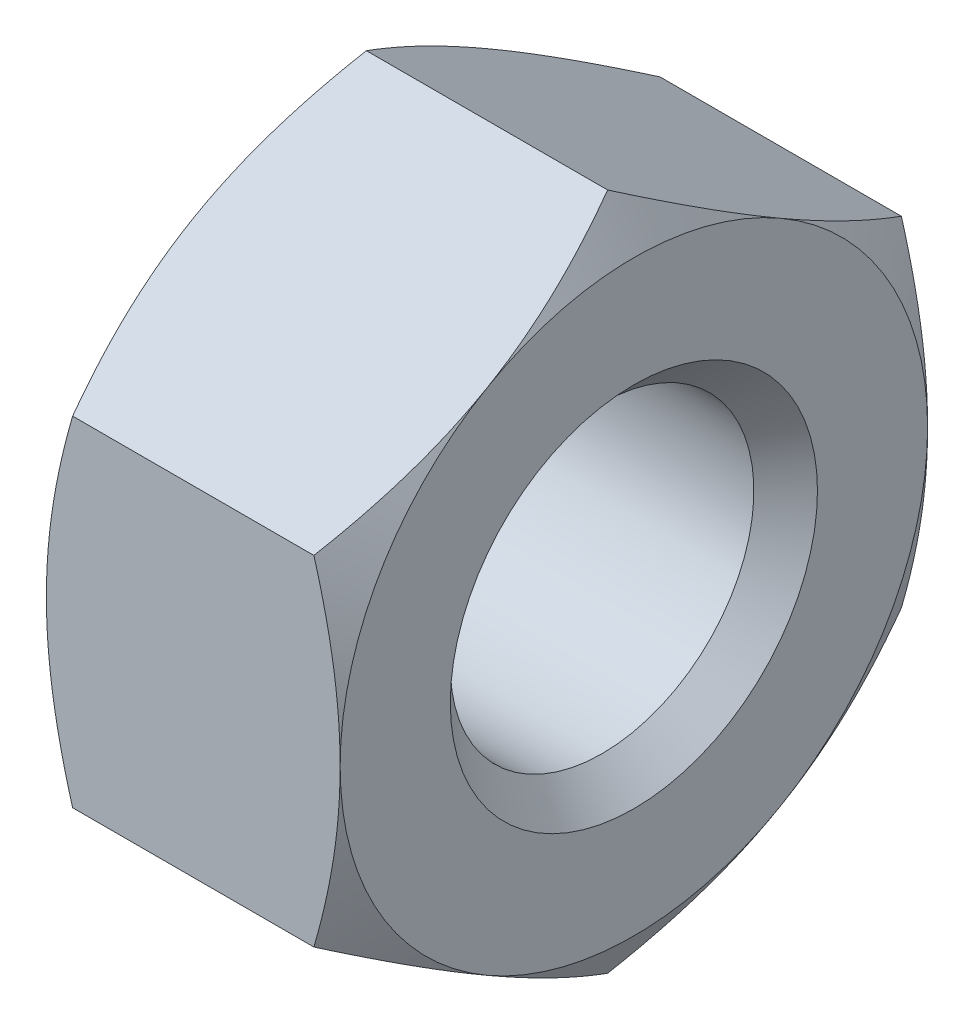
ISO-10303-21;
HEADER;
FILE_DESCRIPTION(('STEP AP214'),'2;1');
FILE_NAME('part.step','',(''),(''),'','','');
FILE_SCHEMA(('AUTOMOTIVE_DESIGN { 1 0 10303 214 1 1 1 1 }'));
ENDSEC;
DATA;
#1=APPLICATION_CONTEXT('core data for automotive mechanical design processes');
#2=APPLICATION_PROTOCOL_DEFINITION('international standard','automotive_design',2000,#1);
#3=PRODUCT_CONTEXT('',#1,'mechanical');
#4=PRODUCT('Part','Part','',(#3));
#5=PRODUCT_RELATED_PRODUCT_CATEGORY('part','',(#4));
#6=PRODUCT_DEFINITION_FORMATION('','',#4);
#7=PRODUCT_DEFINITION_CONTEXT('part definition',#1,'design');
#8=PRODUCT_DEFINITION('design','',#6,#7);
#9=PRODUCT_DEFINITION_SHAPE('','',#8);
#10=(LENGTH_UNIT() NAMED_UNIT(*) SI_UNIT(.MILLI.,.METRE.));
#11=(NAMED_UNIT(*) PLANE_ANGLE_UNIT() SI_UNIT($,.RADIAN.));
#12=(NAMED_UNIT(*) SI_UNIT($,.STERADIAN.) SOLID_ANGLE_UNIT());
#13=UNCERTAINTY_MEASURE_WITH_UNIT(LENGTH_MEASURE(1.E-05),#10,'distance_accuracy_value','');
#14=(GEOMETRIC_REPRESENTATION_CONTEXT(3) GLOBAL_UNCERTAINTY_ASSIGNED_CONTEXT((#13)) GLOBAL_UNIT_ASSIGNED_CONTEXT((#10,
#11,#12)) REPRESENTATION_CONTEXT('',''));
#15=CARTESIAN_POINT('',(0.,0.,0.));
#16=DIRECTION('',(0.,0.,1.));
#17=DIRECTION('',(1.,0.,0.));
#18=AXIS2_PLACEMENT_3D('',#15,#16,#17);
#19=DIRECTION('',(-0.707106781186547,0.707106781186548,0.));
#20=VECTOR('',#19,1.);
#21=CARTESIAN_POINT('',(-498997.5,499000.,0.));
#22=LINE('',#21,#20);
#23=CARTESIAN_POINT('',(2.5,0.,0.));
#24=DIRECTION('',(-1.,0.,0.));
#25=AXIS1_PLACEMENT('',#23,#24);
#26=SURFACE_OF_REVOLUTION('',#22,#25);
#27=CARTESIAN_POINT('',(0.433,0.,0.));
#28=DIRECTION('',(-1.,0.,0.));
#29=DIRECTION('',(0.,1.,0.));
#30=AXIS2_PLACEMENT_3D('',#27,#28,#29);
#31=CIRCLE('',#30,2.067);
#32=CARTESIAN_POINT('',(0.433,2.067,0.));
#33=VERTEX_POINT('',#32);
#34=EDGE_CURVE('E312',#33,#33,#31,.T.);
#35=ORIENTED_EDGE('',*,*,#34,.F.);
#36=EDGE_LOOP('',(#35));
#37=FACE_BOUND('',#36,.T.);
#38=CARTESIAN_POINT('',(0.,0.,0.));
#39=DIRECTION('',(-1.,0.,0.));
#40=DIRECTION('',(0.,1.,0.));
#41=AXIS2_PLACEMENT_3D('',#38,#39,#40);
#42=CIRCLE('',#41,2.5);
#43=CARTESIAN_POINT('',(0.,2.5,0.));
#44=VERTEX_POINT('',#43);
#45=EDGE_CURVE('E297',#44,#44,#42,.T.);
#46=ORIENTED_EDGE('',*,*,#45,.T.);
#47=EDGE_LOOP('',(#46));
#48=FACE_BOUND('',#47,.T.);
#49=ADVANCED_FACE('F16',(#37,#48),#26,.F.);
#50=CARTESIAN_POINT('',(0.,3.25,0.));
#51=DIRECTION('',(-1.,0.,0.));
#52=DIRECTION('',(0.,-1.,0.));
#53=AXIS2_PLACEMENT_3D('',#50,#51,#52);
#54=PLANE('',#53);
#55=CARTESIAN_POINT('',(0.,0.,0.));
#56=DIRECTION('',(-1.,0.,0.));
#57=DIRECTION('',(0.,1.,0.));
#58=AXIS2_PLACEMENT_3D('',#55,#56,#57);
#59=CIRCLE('',#58,4.);
#60=CARTESIAN_POINT('',(0.,3.46410161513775,2.));
#61=VERTEX_POINT('',#60);
#62=CARTESIAN_POINT('',(0.,3.46410161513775,-2.));
#63=VERTEX_POINT('',#62);
#64=EDGE_CURVE('E11',#61,#63,#59,.T.);
#65=ORIENTED_EDGE('',*,*,#64,.T.);
#66=CARTESIAN_POINT('',(0.,0.,0.));
#67=DIRECTION('',(-1.,0.,0.));
#68=DIRECTION('',(0.,1.,0.));
#69=AXIS2_PLACEMENT_3D('',#66,#67,#68);
#70=CIRCLE('',#69,4.);
#71=CARTESIAN_POINT('',(0.,0.,-4.));
#72=VERTEX_POINT('',#71);
#73=EDGE_CURVE('E26',#63,#72,#70,.T.);
#74=ORIENTED_EDGE('',*,*,#73,.T.);
#75=CARTESIAN_POINT('',(0.,0.,0.));
#76=DIRECTION('',(-1.,0.,0.));
#77=DIRECTION('',(0.,1.,0.));
#78=AXIS2_PLACEMENT_3D('',#75,#76,#77);
#79=CIRCLE('',#78,4.);
#80=CARTESIAN_POINT('',(0.,-3.46410161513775,-2.));
#81=VERTEX_POINT('',#80);
#82=EDGE_CURVE('E118',#72,#81,#79,.T.);
#83=ORIENTED_EDGE('',*,*,#82,.T.);
#84=CARTESIAN_POINT('',(0.,0.,0.));
#85=DIRECTION('',(-1.,0.,0.));
#86=DIRECTION('',(0.,1.,0.));
#87=AXIS2_PLACEMENT_3D('',#84,#85,#86);
#88=CIRCLE('',#87,4.);
#89=CARTESIAN_POINT('',(0.,-3.46410161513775,2.));
#90=VERTEX_POINT('',#89);
#91=EDGE_CURVE('E360',#81,#90,#88,.T.);
#92=ORIENTED_EDGE('',*,*,#91,.T.);
#93=CARTESIAN_POINT('',(0.,0.,0.));
#94=DIRECTION('',(-1.,0.,0.));
#95=DIRECTION('',(0.,1.,0.));
#96=AXIS2_PLACEMENT_3D('',#93,#94,#95);
#97=CIRCLE('',#96,4.);
#98=CARTESIAN_POINT('',(0.,0.,4.));
#99=VERTEX_POINT('',#98);
#100=EDGE_CURVE('E363',#90,#99,#97,.T.);
#101=ORIENTED_EDGE('',*,*,#100,.T.);
#102=CARTESIAN_POINT('',(0.,0.,0.));
#103=DIRECTION('',(-1.,0.,0.));
#104=DIRECTION('',(0.,1.,0.));
#105=AXIS2_PLACEMENT_3D('',#102,#103,#104);
#106=CIRCLE('',#105,4.);
#107=EDGE_CURVE('E262',#99,#61,#106,.T.);
#108=ORIENTED_EDGE('',*,*,#107,.T.);
#109=EDGE_LOOP('',(#65,#74,#83,#92,#101,#108));
#110=FACE_BOUND('',#109,.T.);
#111=ORIENTED_EDGE('',*,*,#45,.F.);
#112=EDGE_LOOP('',(#111));
#113=FACE_BOUND('',#112,.T.);
#114=ADVANCED_FACE('F149',(#110,#113),#54,.T.);
#115=CARTESIAN_POINT('',(4.,3.25,0.));
#116=DIRECTION('',(1.,0.,0.));
#117=DIRECTION('',(0.,0.,-1.));
#118=AXIS2_PLACEMENT_3D('',#115,#116,#117);
#119=PLANE('',#118);
#120=CARTESIAN_POINT('',(4.,0.,0.));
#121=DIRECTION('',(-1.,0.,0.));
#122=DIRECTION('',(0.,1.,0.));
#123=AXIS2_PLACEMENT_3D('',#120,#121,#122);
#124=CIRCLE('',#123,2.5);
#125=CARTESIAN_POINT('',(4.,2.5,0.));
#126=VERTEX_POINT('',#125);
#127=EDGE_CURVE('E383',#126,#126,#124,.T.);
#128=ORIENTED_EDGE('',*,*,#127,.T.);
#129=EDGE_LOOP('',(#128));
#130=FACE_BOUND('',#129,.T.);
#131=CARTESIAN_POINT('',(4.,0.,0.));
#132=DIRECTION('',(-1.,0.,0.));
#133=DIRECTION('',(0.,1.,0.));
#134=AXIS2_PLACEMENT_3D('',#131,#132,#133);
#135=CIRCLE('',#134,4.);
#136=CARTESIAN_POINT('',(4.,3.46410161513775,2.));
#137=VERTEX_POINT('',#136);
#138=CARTESIAN_POINT('',(4.,3.46410161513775,-2.));
#139=VERTEX_POINT('',#138);
#140=EDGE_CURVE('E336',#137,#139,#135,.T.);
#141=ORIENTED_EDGE('',*,*,#140,.F.);
#142=CARTESIAN_POINT('',(4.,0.,0.));
#143=DIRECTION('',(-1.,0.,0.));
#144=DIRECTION('',(0.,1.,0.));
#145=AXIS2_PLACEMENT_3D('',#142,#143,#144);
#146=CIRCLE('',#145,4.);
#147=CARTESIAN_POINT('',(4.,0.,4.));
#148=VERTEX_POINT('',#147);
#149=EDGE_CURVE('E137',#148,#137,#146,.T.);
#150=ORIENTED_EDGE('',*,*,#149,.F.);
#151=CARTESIAN_POINT('',(4.,0.,0.));
#152=DIRECTION('',(-1.,0.,0.));
#153=DIRECTION('',(0.,1.,0.));
#154=AXIS2_PLACEMENT_3D('',#151,#152,#153);
#155=CIRCLE('',#154,4.);
#156=CARTESIAN_POINT('',(4.,-3.46410161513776,2.));
#157=VERTEX_POINT('',#156);
#158=EDGE_CURVE('E281',#157,#148,#155,.T.);
#159=ORIENTED_EDGE('',*,*,#158,.F.);
#160=CARTESIAN_POINT('',(4.,0.,0.));
#161=DIRECTION('',(-1.,0.,0.));
#162=DIRECTION('',(0.,1.,0.));
#163=AXIS2_PLACEMENT_3D('',#160,#161,#162);
#164=CIRCLE('',#163,4.);
#165=CARTESIAN_POINT('',(4.,-3.46410161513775,-2.));
#166=VERTEX_POINT('',#165);
#167=EDGE_CURVE('E369',#166,#157,#164,.T.);
#168=ORIENTED_EDGE('',*,*,#167,.F.);
#169=CARTESIAN_POINT('',(4.,0.,0.));
#170=DIRECTION('',(-1.,0.,0.));
#171=DIRECTION('',(0.,1.,0.));
#172=AXIS2_PLACEMENT_3D('',#169,#170,#171);
#173=CIRCLE('',#172,4.);
#174=CARTESIAN_POINT('',(4.,0.,-4.));
#175=VERTEX_POINT('',#174);
#176=EDGE_CURVE('E302',#175,#166,#173,.T.);
#177=ORIENTED_EDGE('',*,*,#176,.F.);
#178=CARTESIAN_POINT('',(4.,0.,0.));
#179=DIRECTION('',(-1.,0.,0.));
#180=DIRECTION('',(0.,1.,0.));
#181=AXIS2_PLACEMENT_3D('',#178,#179,#180);
#182=CIRCLE('',#181,4.);
#183=EDGE_CURVE('E292',#139,#175,#182,.T.);
#184=ORIENTED_EDGE('',*,*,#183,.F.);
#185=EDGE_LOOP('',(#141,#150,#159,#168,#177,#184));
#186=FACE_BOUND('',#185,.T.);
#187=ADVANCED_FACE('F153',(#130,#186),#119,.T.);
#188=DIRECTION('',(0.707106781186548,0.707106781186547,0.));
#189=VECTOR('',#188,1.);
#190=CARTESIAN_POINT('',(499000.,498998.499999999,0.));
#191=LINE('',#190,#189);
#192=CARTESIAN_POINT('',(1.5,0.,0.));
#193=DIRECTION('',(1.,0.,0.));
#194=AXIS1_PLACEMENT('',#192,#193);
#195=SURFACE_OF_REVOLUTION('',#191,#194);
#196=ORIENTED_EDGE('',*,*,#127,.F.);
#197=EDGE_LOOP('',(#196));
#198=FACE_BOUND('',#197,.T.);
#199=CARTESIAN_POINT('',(3.567,0.,0.));
#200=DIRECTION('',(-1.,0.,0.));
#201=DIRECTION('',(0.,1.,0.));
#202=AXIS2_PLACEMENT_3D('',#199,#200,#201);
#203=CIRCLE('',#202,2.067);
#204=CARTESIAN_POINT('',(3.567,2.067,0.));
#205=VERTEX_POINT('',#204);
#206=EDGE_CURVE('E127',#205,#205,#203,.T.);
#207=ORIENTED_EDGE('',*,*,#206,.T.);
#208=EDGE_LOOP('',(#207));
#209=FACE_BOUND('',#208,.T.);
#210=ADVANCED_FACE('F157',(#198,#209),#195,.F.);
#211=CARTESIAN_POINT('',(2.,0.,0.));
#212=DIRECTION('',(1.,0.,0.));
#213=DIRECTION('',(0.,1.,0.));
#214=AXIS2_PLACEMENT_3D('',#211,#212,#213);
#215=CIRCLE('',#214,2.067);
#216=DIRECTION('',(-1.,0.,0.));
#217=VECTOR('',#216,1.);
#218=SURFACE_OF_LINEAR_EXTRUSION('',#215,#217);
#219=ORIENTED_EDGE('',*,*,#206,.F.);
#220=EDGE_LOOP('',(#219));
#221=FACE_BOUND('',#220,.T.);
#222=ORIENTED_EDGE('',*,*,#34,.T.);
#223=EDGE_LOOP('',(#222));
#224=FACE_BOUND('',#223,.T.);
#225=ADVANCED_FACE('F161',(#221,#224),#218,.T.);
#226=DIRECTION('',(0.5,-0.866025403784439,0.));
#227=VECTOR('',#226,1.);
#228=CARTESIAN_POINT('',(-288091.474924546,499000.,0.));
#229=LINE('',#228,#227);
#230=CARTESIAN_POINT('',(6.3094010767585,0.,0.));
#231=DIRECTION('',(-1.,0.,0.));
#232=AXIS1_PLACEMENT('',#230,#231);
#233=SURFACE_OF_REVOLUTION('',#229,#232);
#234=CARTESIAN_POINT('',(4.,3.46410161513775,2.));
#235=CARTESIAN_POINT('',(4.,2.92820323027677,2.92820323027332));
#236=CARTESIAN_POINT('',(3.64273441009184,2.3094010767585,4.));
#237=(BOUNDED_CURVE() B_SPLINE_CURVE(2,(#234,#235,#236),.UNSPECIFIED.,.F.,
.F.) B_SPLINE_CURVE_WITH_KNOTS((3,3),(6.65279109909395,9.59814287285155),
.UNSPECIFIED.) CURVE() GEOMETRIC_REPRESENTATION_ITEM() RATIONAL_B_SPLINE_CURVE((1.,
1.08725434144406,1.09724946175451)) REPRESENTATION_ITEM(''));
#238=CARTESIAN_POINT('',(3.64273441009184,2.3094010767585,4.));
#239=VERTEX_POINT('',#238);
#240=EDGE_CURVE('E277',#137,#239,#237,.T.);
#241=ORIENTED_EDGE('',*,*,#240,.T.);
#242=CARTESIAN_POINT('',(3.64273441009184,2.3094010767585,4.));
#243=CARTESIAN_POINT('',(4.,1.07179676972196,4.));
#244=CARTESIAN_POINT('',(4.,0.,4.));
#245=(BOUNDED_CURVE() B_SPLINE_CURVE(2,(#242,#243,#244),.UNSPECIFIED.,.F.,
.F.) B_SPLINE_CURVE_WITH_KNOTS((3,3),(3.70743932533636,6.65279109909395),
.UNSPECIFIED.) CURVE() GEOMETRIC_REPRESENTATION_ITEM() RATIONAL_B_SPLINE_CURVE((1.09724946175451,
1.08725434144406,1.)) REPRESENTATION_ITEM(''));
#246=EDGE_CURVE('E268',#239,#148,#245,.T.);
#247=ORIENTED_EDGE('',*,*,#246,.T.);
#248=ORIENTED_EDGE('',*,*,#149,.T.);
#249=EDGE_LOOP('',(#241,#247,#248));
#250=FACE_BOUND('',#249,.T.);
#251=ADVANCED_FACE('F165',(#250),#233,.F.);
#252=DIRECTION('',(0.5,-0.866025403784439,0.));
#253=VECTOR('',#252,1.);
#254=CARTESIAN_POINT('',(-288091.474924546,499000.,0.));
#255=LINE('',#254,#253);
#256=CARTESIAN_POINT('',(6.3094010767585,0.,0.));
#257=DIRECTION('',(-1.,0.,0.));
#258=AXIS1_PLACEMENT('',#256,#257);
#259=SURFACE_OF_REVOLUTION('',#255,#258);
#260=CARTESIAN_POINT('',(4.,3.46410161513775,-2.));
#261=CARTESIAN_POINT('',(4.,3.99999999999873,-1.07179676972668));
#262=CARTESIAN_POINT('',(3.64273441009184,4.61880215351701,0.));
#263=(BOUNDED_CURVE() B_SPLINE_CURVE(2,(#260,#261,#262),.UNSPECIFIED.,.F.,
.F.) B_SPLINE_CURVE_WITH_KNOTS((3,3),(6.65279109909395,9.59814287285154),
.UNSPECIFIED.) CURVE() GEOMETRIC_REPRESENTATION_ITEM() RATIONAL_B_SPLINE_CURVE((1.,
1.08725434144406,1.09724946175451)) REPRESENTATION_ITEM(''));
#264=CARTESIAN_POINT('',(3.64273441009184,4.61880215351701,0.));
#265=VERTEX_POINT('',#264);
#266=EDGE_CURVE('E129',#139,#265,#263,.T.);
#267=ORIENTED_EDGE('',*,*,#266,.T.);
#268=CARTESIAN_POINT('',(3.64273441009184,4.61880215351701,0.));
#269=CARTESIAN_POINT('',(4.,3.99999999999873,1.07179676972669));
#270=CARTESIAN_POINT('',(4.,3.46410161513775,2.));
#271=(BOUNDED_CURVE() B_SPLINE_CURVE(2,(#268,#269,#270),.UNSPECIFIED.,.F.,
.F.) B_SPLINE_CURVE_WITH_KNOTS((3,3),(3.70743932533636,6.65279109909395),
.UNSPECIFIED.) CURVE() GEOMETRIC_REPRESENTATION_ITEM() RATIONAL_B_SPLINE_CURVE((1.09724946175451,
1.08725434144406,1.)) REPRESENTATION_ITEM(''));
#272=EDGE_CURVE('E138',#265,#137,#271,.T.);
#273=ORIENTED_EDGE('',*,*,#272,.T.);
#274=ORIENTED_EDGE('',*,*,#140,.T.);
#275=EDGE_LOOP('',(#267,#273,#274));
#276=FACE_BOUND('',#275,.T.);
#277=ADVANCED_FACE('F176',(#276),#259,.F.);
#278=DIRECTION('',(0.5,-0.866025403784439,0.));
#279=VECTOR('',#278,1.);
#280=CARTESIAN_POINT('',(-288091.474924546,499000.,0.));
#281=LINE('',#280,#279);
#282=CARTESIAN_POINT('',(6.3094010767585,0.,0.));
#283=DIRECTION('',(-1.,0.,0.));
#284=AXIS1_PLACEMENT('',#282,#283);
#285=SURFACE_OF_REVOLUTION('',#281,#284);
#286=CARTESIAN_POINT('',(4.,0.,-4.));
#287=CARTESIAN_POINT('',(4.,1.07179676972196,-4.));
#288=CARTESIAN_POINT('',(3.64273441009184,2.3094010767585,-4.));
#289=(BOUNDED_CURVE() B_SPLINE_CURVE(2,(#286,#287,#288),.UNSPECIFIED.,.F.,
.F.) B_SPLINE_CURVE_WITH_KNOTS((3,3),(6.65279109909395,9.59814287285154),
.UNSPECIFIED.) CURVE() GEOMETRIC_REPRESENTATION_ITEM() RATIONAL_B_SPLINE_CURVE((1.,
1.08725434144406,1.09724946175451)) REPRESENTATION_ITEM(''));
#290=CARTESIAN_POINT('',(3.64273441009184,2.3094010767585,-4.));
#291=VERTEX_POINT('',#290);
#292=EDGE_CURVE('E291',#175,#291,#289,.T.);
#293=ORIENTED_EDGE('',*,*,#292,.T.);
#294=CARTESIAN_POINT('',(3.64273441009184,2.3094010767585,-4.));
#295=CARTESIAN_POINT('',(4.,2.92820323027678,-2.92820323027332));
#296=CARTESIAN_POINT('',(4.,3.46410161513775,-2.));
#297=(BOUNDED_CURVE() B_SPLINE_CURVE(2,(#294,#295,#296),.UNSPECIFIED.,.F.,
.F.) B_SPLINE_CURVE_WITH_KNOTS((3,3),(3.70743932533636,6.65279109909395),
.UNSPECIFIED.) CURVE() GEOMETRIC_REPRESENTATION_ITEM() RATIONAL_B_SPLINE_CURVE((1.09724946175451,
1.08725434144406,1.)) REPRESENTATION_ITEM(''));
#298=EDGE_CURVE('E286',#291,#139,#297,.T.);
#299=ORIENTED_EDGE('',*,*,#298,.T.);
#300=ORIENTED_EDGE('',*,*,#183,.T.);
#301=EDGE_LOOP('',(#293,#299,#300));
#302=FACE_BOUND('',#301,.T.);
#303=ADVANCED_FACE('F179',(#302),#285,.F.);
#304=DIRECTION('',(0.5,-0.866025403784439,0.));
#305=VECTOR('',#304,1.);
#306=CARTESIAN_POINT('',(-288091.474924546,499000.,0.));
#307=LINE('',#306,#305);
#308=CARTESIAN_POINT('',(6.3094010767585,0.,0.));
#309=DIRECTION('',(-1.,0.,0.));
#310=AXIS1_PLACEMENT('',#308,#309);
#311=SURFACE_OF_REVOLUTION('',#307,#310);
#312=CARTESIAN_POINT('',(3.64273441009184,-2.3094010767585,-4.));
#313=CARTESIAN_POINT('',(4.,-1.07179676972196,-4.));
#314=CARTESIAN_POINT('',(4.,0.,-4.));
#315=(BOUNDED_CURVE() B_SPLINE_CURVE(2,(#312,#313,#314),.UNSPECIFIED.,.F.,
.F.) B_SPLINE_CURVE_WITH_KNOTS((3,3),(3.70743932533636,6.65279109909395),
.UNSPECIFIED.) CURVE() GEOMETRIC_REPRESENTATION_ITEM() RATIONAL_B_SPLINE_CURVE((1.09724946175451,
1.08725434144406,1.)) REPRESENTATION_ITEM(''));
#316=CARTESIAN_POINT('',(3.64273441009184,-2.3094010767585,-4.));
#317=VERTEX_POINT('',#316);
#318=EDGE_CURVE('E101',#317,#175,#315,.T.);
#319=ORIENTED_EDGE('',*,*,#318,.T.);
#320=ORIENTED_EDGE('',*,*,#176,.T.);
#321=CARTESIAN_POINT('',(4.,-3.46410161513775,-2.));
#322=CARTESIAN_POINT('',(4.,-2.92820323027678,-2.92820323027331));
#323=CARTESIAN_POINT('',(3.64273441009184,-2.3094010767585,-4.));
#324=(BOUNDED_CURVE() B_SPLINE_CURVE(2,(#321,#322,#323),.UNSPECIFIED.,.F.,
.F.) B_SPLINE_CURVE_WITH_KNOTS((3,3),(6.65279109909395,9.59814287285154),
.UNSPECIFIED.) CURVE() GEOMETRIC_REPRESENTATION_ITEM() RATIONAL_B_SPLINE_CURVE((1.,
1.08725434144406,1.09724946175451)) REPRESENTATION_ITEM(''));
#325=EDGE_CURVE('E298',#166,#317,#324,.T.);
#326=ORIENTED_EDGE('',*,*,#325,.T.);
#327=EDGE_LOOP('',(#319,#320,#326));
#328=FACE_BOUND('',#327,.T.);
#329=ADVANCED_FACE('F183',(#328),#311,.F.);
#330=DIRECTION('',(0.5,-0.866025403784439,0.));
#331=VECTOR('',#330,1.);
#332=CARTESIAN_POINT('',(-288091.474924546,499000.,0.));
#333=LINE('',#332,#331);
#334=CARTESIAN_POINT('',(6.3094010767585,0.,0.));
#335=DIRECTION('',(-1.,0.,0.));
#336=AXIS1_PLACEMENT('',#334,#335);
#337=SURFACE_OF_REVOLUTION('',#333,#336);
#338=CARTESIAN_POINT('',(3.64273441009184,-4.61880215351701,0.));
#339=CARTESIAN_POINT('',(4.,-3.99999999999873,-1.07179676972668));
#340=CARTESIAN_POINT('',(4.,-3.46410161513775,-2.));
#341=(BOUNDED_CURVE() B_SPLINE_CURVE(2,(#338,#339,#340),.UNSPECIFIED.,.F.,
.F.) B_SPLINE_CURVE_WITH_KNOTS((3,3),(3.70743932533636,6.65279109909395),
.UNSPECIFIED.) CURVE() GEOMETRIC_REPRESENTATION_ITEM() RATIONAL_B_SPLINE_CURVE((1.09724946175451,
1.08725434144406,1.)) REPRESENTATION_ITEM(''));
#342=CARTESIAN_POINT('',(3.64273441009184,-4.61880215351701,0.));
#343=VERTEX_POINT('',#342);
#344=EDGE_CURVE('E303',#343,#166,#341,.T.);
#345=ORIENTED_EDGE('',*,*,#344,.T.);
#346=ORIENTED_EDGE('',*,*,#167,.T.);
#347=CARTESIAN_POINT('',(4.,-3.46410161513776,2.));
#348=CARTESIAN_POINT('',(4.,-3.99999999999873,1.07179676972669));
#349=CARTESIAN_POINT('',(3.64273441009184,-4.61880215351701,0.));
#350=(BOUNDED_CURVE() B_SPLINE_CURVE(2,(#347,#348,#349),.UNSPECIFIED.,.F.,
.F.) B_SPLINE_CURVE_WITH_KNOTS((3,3),(6.65279109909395,9.59814287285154),
.UNSPECIFIED.) CURVE() GEOMETRIC_REPRESENTATION_ITEM() RATIONAL_B_SPLINE_CURVE((1.,
1.08725434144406,1.09724946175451)) REPRESENTATION_ITEM(''));
#351=EDGE_CURVE('E311',#157,#343,#350,.T.);
#352=ORIENTED_EDGE('',*,*,#351,.T.);
#353=EDGE_LOOP('',(#345,#346,#352));
#354=FACE_BOUND('',#353,.T.);
#355=ADVANCED_FACE('F187',(#354),#337,.F.);
#356=DIRECTION('',(0.5,-0.866025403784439,0.));
#357=VECTOR('',#356,1.);
#358=CARTESIAN_POINT('',(-288091.474924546,499000.,0.));
#359=LINE('',#358,#357);
#360=CARTESIAN_POINT('',(6.3094010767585,0.,0.));
#361=DIRECTION('',(-1.,0.,0.));
#362=AXIS1_PLACEMENT('',#360,#361);
#363=SURFACE_OF_REVOLUTION('',#359,#362);
#364=CARTESIAN_POINT('',(3.64273441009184,-2.3094010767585,4.));
#365=CARTESIAN_POINT('',(4.,-2.92820323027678,2.92820323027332));
#366=CARTESIAN_POINT('',(4.,-3.46410161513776,2.));
#367=(BOUNDED_CURVE() B_SPLINE_CURVE(2,(#364,#365,#366),.UNSPECIFIED.,.F.,
.F.) B_SPLINE_CURVE_WITH_KNOTS((3,3),(3.70743932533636,6.65279109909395),
.UNSPECIFIED.) CURVE() GEOMETRIC_REPRESENTATION_ITEM() RATIONAL_B_SPLINE_CURVE((1.09724946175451,
1.08725434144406,1.)) REPRESENTATION_ITEM(''));
#368=CARTESIAN_POINT('',(3.64273441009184,-2.3094010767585,4.));
#369=VERTEX_POINT('',#368);
#370=EDGE_CURVE('E284',#369,#157,#367,.T.);
#371=ORIENTED_EDGE('',*,*,#370,.T.);
#372=ORIENTED_EDGE('',*,*,#158,.T.);
#373=CARTESIAN_POINT('',(4.,0.,4.));
#374=CARTESIAN_POINT('',(4.,-1.07179676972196,4.));
#375=CARTESIAN_POINT('',(3.64273441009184,-2.3094010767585,4.));
#376=(BOUNDED_CURVE() B_SPLINE_CURVE(2,(#373,#374,#375),.UNSPECIFIED.,.F.,
.F.) B_SPLINE_CURVE_WITH_KNOTS((3,3),(6.65279109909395,9.59814287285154),
.UNSPECIFIED.) CURVE() GEOMETRIC_REPRESENTATION_ITEM() RATIONAL_B_SPLINE_CURVE((1.,
1.08725434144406,1.09724946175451)) REPRESENTATION_ITEM(''));
#377=EDGE_CURVE('E285',#148,#369,#376,.T.);
#378=ORIENTED_EDGE('',*,*,#377,.T.);
#379=EDGE_LOOP('',(#371,#372,#378));
#380=FACE_BOUND('',#379,.T.);
#381=ADVANCED_FACE('F198',(#380),#363,.F.);
#382=DIRECTION('',(-0.5,-0.866025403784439,0.));
#383=VECTOR('',#382,1.);
#384=CARTESIAN_POINT('',(288095.474924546,499000.,0.));
#385=LINE('',#384,#383);
#386=CARTESIAN_POINT('',(-2.3094010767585,0.,0.));
#387=DIRECTION('',(1.,0.,0.));
#388=AXIS1_PLACEMENT('',#386,#387);
#389=SURFACE_OF_REVOLUTION('',#385,#388);
#390=CARTESIAN_POINT('',(0.,3.46410161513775,2.));
#391=CARTESIAN_POINT('',(0.,3.99999999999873,1.07179676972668));
#392=CARTESIAN_POINT('',(0.357265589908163,4.61880215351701,0.));
#393=(BOUNDED_CURVE() B_SPLINE_CURVE(2,(#390,#391,#392),.UNSPECIFIED.,.F.,
.F.) B_SPLINE_CURVE_WITH_KNOTS((3,3),(6.65279109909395,9.59814287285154),
.UNSPECIFIED.) CURVE() GEOMETRIC_REPRESENTATION_ITEM() RATIONAL_B_SPLINE_CURVE((1.,
1.08725434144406,1.09724946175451)) REPRESENTATION_ITEM(''));
#394=CARTESIAN_POINT('',(0.357265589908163,4.61880215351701,0.));
#395=VERTEX_POINT('',#394);
#396=EDGE_CURVE('E255',#61,#395,#393,.T.);
#397=ORIENTED_EDGE('',*,*,#396,.T.);
#398=CARTESIAN_POINT('',(0.357265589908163,4.61880215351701,0.));
#399=CARTESIAN_POINT('',(0.,3.99999999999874,-1.07179676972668));
#400=CARTESIAN_POINT('',(0.,3.46410161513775,-2.));
#401=(BOUNDED_CURVE() B_SPLINE_CURVE(2,(#398,#399,#400),.UNSPECIFIED.,.F.,
.F.) B_SPLINE_CURVE_WITH_KNOTS((3,3),(3.70743932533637,6.65279109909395),
.UNSPECIFIED.) CURVE() GEOMETRIC_REPRESENTATION_ITEM() RATIONAL_B_SPLINE_CURVE((1.09724946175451,
1.08725434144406,1.)) REPRESENTATION_ITEM(''));
#402=EDGE_CURVE('E265',#395,#63,#401,.T.);
#403=ORIENTED_EDGE('',*,*,#402,.T.);
#404=ORIENTED_EDGE('',*,*,#64,.F.);
#405=EDGE_LOOP('',(#397,#403,#404));
#406=FACE_BOUND('',#405,.T.);
#407=ADVANCED_FACE('F201',(#406),#389,.F.);
#408=DIRECTION('',(-0.5,-0.866025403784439,0.));
#409=VECTOR('',#408,1.);
#410=CARTESIAN_POINT('',(288095.474924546,499000.,0.));
#411=LINE('',#410,#409);
#412=CARTESIAN_POINT('',(-2.3094010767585,0.,0.));
#413=DIRECTION('',(1.,0.,0.));
#414=AXIS1_PLACEMENT('',#412,#413);
#415=SURFACE_OF_REVOLUTION('',#411,#414);
#416=CARTESIAN_POINT('',(0.,0.,4.));
#417=CARTESIAN_POINT('',(0.,1.07179676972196,4.));
#418=CARTESIAN_POINT('',(0.357265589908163,2.3094010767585,4.));
#419=(BOUNDED_CURVE() B_SPLINE_CURVE(2,(#416,#417,#418),.UNSPECIFIED.,.F.,
.F.) B_SPLINE_CURVE_WITH_KNOTS((3,3),(6.65279109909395,9.59814287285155),
.UNSPECIFIED.) CURVE() GEOMETRIC_REPRESENTATION_ITEM() RATIONAL_B_SPLINE_CURVE((1.,
1.08725434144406,1.09724946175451)) REPRESENTATION_ITEM(''));
#420=CARTESIAN_POINT('',(0.357265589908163,2.3094010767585,4.));
#421=VERTEX_POINT('',#420);
#422=EDGE_CURVE('E258',#99,#421,#419,.T.);
#423=ORIENTED_EDGE('',*,*,#422,.T.);
#424=CARTESIAN_POINT('',(0.357265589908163,2.3094010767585,4.));
#425=CARTESIAN_POINT('',(0.,2.92820323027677,2.92820323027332));
#426=CARTESIAN_POINT('',(0.,3.46410161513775,2.));
#427=(BOUNDED_CURVE() B_SPLINE_CURVE(2,(#424,#425,#426),.UNSPECIFIED.,.F.,
.F.) B_SPLINE_CURVE_WITH_KNOTS((3,3),(3.70743932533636,6.65279109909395),
.UNSPECIFIED.) CURVE() GEOMETRIC_REPRESENTATION_ITEM() RATIONAL_B_SPLINE_CURVE((1.09724946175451,
1.08725434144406,1.)) REPRESENTATION_ITEM(''));
#428=EDGE_CURVE('E248',#421,#61,#427,.T.);
#429=ORIENTED_EDGE('',*,*,#428,.T.);
#430=ORIENTED_EDGE('',*,*,#107,.F.);
#431=EDGE_LOOP('',(#423,#429,#430));
#432=FACE_BOUND('',#431,.T.);
#433=ADVANCED_FACE('F205',(#432),#415,.F.);
#434=DIRECTION('',(-0.5,-0.866025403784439,0.));
#435=VECTOR('',#434,1.);
#436=CARTESIAN_POINT('',(288095.474924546,499000.,0.));
#437=LINE('',#436,#435);
#438=CARTESIAN_POINT('',(-2.3094010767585,0.,0.));
#439=DIRECTION('',(1.,0.,0.));
#440=AXIS1_PLACEMENT('',#438,#439);
#441=SURFACE_OF_REVOLUTION('',#437,#440);
#442=CARTESIAN_POINT('',(0.,-3.46410161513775,2.));
#443=CARTESIAN_POINT('',(0.,-2.92820323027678,2.92820323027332));
#444=CARTESIAN_POINT('',(0.357265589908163,-2.3094010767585,4.));
#445=(BOUNDED_CURVE() B_SPLINE_CURVE(2,(#442,#443,#444),.UNSPECIFIED.,.F.,
.F.) B_SPLINE_CURVE_WITH_KNOTS((3,3),(6.65279109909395,9.59814287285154),
.UNSPECIFIED.) CURVE() GEOMETRIC_REPRESENTATION_ITEM() RATIONAL_B_SPLINE_CURVE((1.,
1.08725434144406,1.09724946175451)) REPRESENTATION_ITEM(''));
#446=CARTESIAN_POINT('',(0.357265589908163,-2.3094010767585,4.));
#447=VERTEX_POINT('',#446);
#448=EDGE_CURVE('E259',#90,#447,#445,.T.);
#449=ORIENTED_EDGE('',*,*,#448,.T.);
#450=CARTESIAN_POINT('',(0.357265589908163,-2.3094010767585,4.));
#451=CARTESIAN_POINT('',(0.,-1.07179676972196,4.));
#452=CARTESIAN_POINT('',(0.,0.,4.));
#453=(BOUNDED_CURVE() B_SPLINE_CURVE(2,(#450,#451,#452),.UNSPECIFIED.,.F.,
.F.) B_SPLINE_CURVE_WITH_KNOTS((3,3),(3.70743932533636,6.65279109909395),
.UNSPECIFIED.) CURVE() GEOMETRIC_REPRESENTATION_ITEM() RATIONAL_B_SPLINE_CURVE((1.09724946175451,
1.08725434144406,1.)) REPRESENTATION_ITEM(''));
#454=EDGE_CURVE('E322',#447,#99,#453,.T.);
#455=ORIENTED_EDGE('',*,*,#454,.T.);
#456=ORIENTED_EDGE('',*,*,#100,.F.);
#457=EDGE_LOOP('',(#449,#455,#456));
#458=FACE_BOUND('',#457,.T.);
#459=ADVANCED_FACE('F209',(#458),#441,.F.);
#460=DIRECTION('',(-0.5,-0.866025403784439,0.));
#461=VECTOR('',#460,1.);
#462=CARTESIAN_POINT('',(288095.474924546,499000.,0.));
#463=LINE('',#462,#461);
#464=CARTESIAN_POINT('',(-2.3094010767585,0.,0.));
#465=DIRECTION('',(1.,0.,0.));
#466=AXIS1_PLACEMENT('',#464,#465);
#467=SURFACE_OF_REVOLUTION('',#463,#466);
#468=CARTESIAN_POINT('',(0.357265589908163,-4.61880215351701,0.));
#469=CARTESIAN_POINT('',(0.,-3.99999999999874,1.07179676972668));
#470=CARTESIAN_POINT('',(0.,-3.46410161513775,2.));
#471=(BOUNDED_CURVE() B_SPLINE_CURVE(2,(#468,#469,#470),.UNSPECIFIED.,.F.,
.F.) B_SPLINE_CURVE_WITH_KNOTS((3,3),(3.70743932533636,6.65279109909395),
.UNSPECIFIED.) CURVE() GEOMETRIC_REPRESENTATION_ITEM() RATIONAL_B_SPLINE_CURVE((1.09724946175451,
1.08725434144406,1.)) REPRESENTATION_ITEM(''));
#472=CARTESIAN_POINT('',(0.357265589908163,-4.61880215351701,0.));
#473=VERTEX_POINT('',#472);
#474=EDGE_CURVE('E318',#473,#90,#471,.T.);
#475=ORIENTED_EDGE('',*,*,#474,.T.);
#476=ORIENTED_EDGE('',*,*,#91,.F.);
#477=CARTESIAN_POINT('',(0.,-3.46410161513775,-2.));
#478=CARTESIAN_POINT('',(0.,-3.99999999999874,-1.07179676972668));
#479=CARTESIAN_POINT('',(0.357265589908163,-4.61880215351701,0.));
#480=(BOUNDED_CURVE() B_SPLINE_CURVE(2,(#477,#478,#479),.UNSPECIFIED.,.F.,
.F.) B_SPLINE_CURVE_WITH_KNOTS((3,3),(6.65279109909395,9.59814287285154),
.UNSPECIFIED.) CURVE() GEOMETRIC_REPRESENTATION_ITEM() RATIONAL_B_SPLINE_CURVE((1.,
1.08725434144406,1.09724946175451)) REPRESENTATION_ITEM(''));
#481=EDGE_CURVE('E112',#81,#473,#480,.T.);
#482=ORIENTED_EDGE('',*,*,#481,.T.);
#483=EDGE_LOOP('',(#475,#476,#482));
#484=FACE_BOUND('',#483,.T.);
#485=ADVANCED_FACE('F218',(#484),#467,.F.);
#486=DIRECTION('',(-0.5,-0.866025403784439,0.));
#487=VECTOR('',#486,1.);
#488=CARTESIAN_POINT('',(288095.474924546,499000.,0.));
#489=LINE('',#488,#487);
#490=CARTESIAN_POINT('',(-2.3094010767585,0.,0.));
#491=DIRECTION('',(1.,0.,0.));
#492=AXIS1_PLACEMENT('',#490,#491);
#493=SURFACE_OF_REVOLUTION('',#489,#492);
#494=CARTESIAN_POINT('',(0.357265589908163,-2.3094010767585,-4.));
#495=CARTESIAN_POINT('',(0.,-2.92820323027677,-2.92820323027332));
#496=CARTESIAN_POINT('',(0.,-3.46410161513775,-2.));
#497=(BOUNDED_CURVE() B_SPLINE_CURVE(2,(#494,#495,#496),.UNSPECIFIED.,.F.,
.F.) B_SPLINE_CURVE_WITH_KNOTS((3,3),(3.70743932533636,6.65279109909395),
.UNSPECIFIED.) CURVE() GEOMETRIC_REPRESENTATION_ITEM() RATIONAL_B_SPLINE_CURVE((1.09724946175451,
1.08725434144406,1.)) REPRESENTATION_ITEM(''));
#498=CARTESIAN_POINT('',(0.357265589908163,-2.3094010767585,-4.));
#499=VERTEX_POINT('',#498);
#500=EDGE_CURVE('E109',#499,#81,#497,.T.);
#501=ORIENTED_EDGE('',*,*,#500,.T.);
#502=ORIENTED_EDGE('',*,*,#82,.F.);
#503=CARTESIAN_POINT('',(0.,0.,-4.));
#504=CARTESIAN_POINT('',(0.,-1.07179676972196,-4.));
#505=CARTESIAN_POINT('',(0.357265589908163,-2.3094010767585,-4.));
#506=(BOUNDED_CURVE() B_SPLINE_CURVE(2,(#503,#504,#505),.UNSPECIFIED.,.F.,
.F.) B_SPLINE_CURVE_WITH_KNOTS((3,3),(6.65279109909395,9.59814287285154),
.UNSPECIFIED.) CURVE() GEOMETRIC_REPRESENTATION_ITEM() RATIONAL_B_SPLINE_CURVE((1.,
1.08725434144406,1.09724946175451)) REPRESENTATION_ITEM(''));
#507=EDGE_CURVE('E98',#72,#499,#506,.T.);
#508=ORIENTED_EDGE('',*,*,#507,.T.);
#509=EDGE_LOOP('',(#501,#502,#508));
#510=FACE_BOUND('',#509,.T.);
#511=ADVANCED_FACE('F117',(#510),#493,.F.);
#512=DIRECTION('',(-0.5,-0.866025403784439,0.));
#513=VECTOR('',#512,1.);
#514=CARTESIAN_POINT('',(288095.474924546,499000.,0.));
#515=LINE('',#514,#513);
#516=CARTESIAN_POINT('',(-2.3094010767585,0.,0.));
#517=DIRECTION('',(1.,0.,0.));
#518=AXIS1_PLACEMENT('',#516,#517);
#519=SURFACE_OF_REVOLUTION('',#515,#518);
#520=CARTESIAN_POINT('',(0.357265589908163,2.3094010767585,-4.));
#521=CARTESIAN_POINT('',(0.,1.07179676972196,-4.));
#522=CARTESIAN_POINT('',(0.,0.,-4.));
#523=(BOUNDED_CURVE() B_SPLINE_CURVE(2,(#520,#521,#522),.UNSPECIFIED.,.F.,
.F.) B_SPLINE_CURVE_WITH_KNOTS((3,3),(3.70743932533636,6.65279109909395),
.UNSPECIFIED.) CURVE() GEOMETRIC_REPRESENTATION_ITEM() RATIONAL_B_SPLINE_CURVE((1.09724946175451,
1.08725434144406,1.)) REPRESENTATION_ITEM(''));
#524=CARTESIAN_POINT('',(0.357265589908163,2.3094010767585,-4.));
#525=VERTEX_POINT('',#524);
#526=EDGE_CURVE('E120',#525,#72,#523,.T.);
#527=ORIENTED_EDGE('',*,*,#526,.T.);
#528=ORIENTED_EDGE('',*,*,#73,.F.);
#529=CARTESIAN_POINT('',(0.,3.46410161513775,-2.));
#530=CARTESIAN_POINT('',(0.,2.92820323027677,-2.92820323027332));
#531=CARTESIAN_POINT('',(0.357265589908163,2.3094010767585,-4.));
#532=(BOUNDED_CURVE() B_SPLINE_CURVE(2,(#529,#530,#531),.UNSPECIFIED.,.F.,
.F.) B_SPLINE_CURVE_WITH_KNOTS((3,3),(6.65279109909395,9.59814287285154),
.UNSPECIFIED.) CURVE() GEOMETRIC_REPRESENTATION_ITEM() RATIONAL_B_SPLINE_CURVE((1.,
1.08725434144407,1.09724946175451)) REPRESENTATION_ITEM(''));
#533=EDGE_CURVE('E35',#63,#525,#532,.T.);
#534=ORIENTED_EDGE('',*,*,#533,.T.);
#535=EDGE_LOOP('',(#527,#528,#534));
#536=FACE_BOUND('',#535,.T.);
#537=ADVANCED_FACE('F224',(#536),#519,.F.);
#538=CARTESIAN_POINT('',(5.,-2.3094010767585,-4.));
#539=DIRECTION('',(0.,-0.866025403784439,-0.5));
#540=DIRECTION('',(0.,0.5,-0.866025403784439));
#541=AXIS2_PLACEMENT_3D('',#538,#539,#540);
#542=PLANE('',#541);
#543=ORIENTED_EDGE('',*,*,#481,.F.);
#544=ORIENTED_EDGE('',*,*,#500,.F.);
#545=DIRECTION('',(-1.,0.,0.));
#546=VECTOR('',#545,1.);
#547=CARTESIAN_POINT('',(5.,-2.3094010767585,-4.));
#548=LINE('',#547,#546);
#549=EDGE_CURVE('E93',#317,#499,#548,.T.);
#550=ORIENTED_EDGE('',*,*,#549,.F.);
#551=ORIENTED_EDGE('',*,*,#325,.F.);
#552=ORIENTED_EDGE('',*,*,#344,.F.);
#553=DIRECTION('',(-1.,0.,0.));
#554=VECTOR('',#553,1.);
#555=CARTESIAN_POINT('',(5.,-4.61880215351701,0.));
#556=LINE('',#555,#554);
#557=EDGE_CURVE('E105',#343,#473,#556,.T.);
#558=ORIENTED_EDGE('',*,*,#557,.T.);
#559=EDGE_LOOP('',(#543,#544,#550,#551,#552,#558));
#560=FACE_BOUND('',#559,.T.);
#561=ADVANCED_FACE('F110',(#560),#542,.T.);
#562=CARTESIAN_POINT('',(5.,2.3094010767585,-4.));
#563=DIRECTION('',(0.,0.,-1.));
#564=DIRECTION('',(-1.,0.,0.));
#565=AXIS2_PLACEMENT_3D('',#562,#563,#564);
#566=PLANE('',#565);
#567=ORIENTED_EDGE('',*,*,#507,.F.);
#568=ORIENTED_EDGE('',*,*,#526,.F.);
#569=DIRECTION('',(-1.,0.,0.));
#570=VECTOR('',#569,1.);
#571=CARTESIAN_POINT('',(5.,2.3094010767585,-4.));
#572=LINE('',#571,#570);
#573=EDGE_CURVE('E106',#291,#525,#572,.T.);
#574=ORIENTED_EDGE('',*,*,#573,.F.);
#575=ORIENTED_EDGE('',*,*,#292,.F.);
#576=ORIENTED_EDGE('',*,*,#318,.F.);
#577=ORIENTED_EDGE('',*,*,#549,.T.);
#578=EDGE_LOOP('',(#567,#568,#574,#575,#576,#577));
#579=FACE_BOUND('',#578,.T.);
#580=ADVANCED_FACE('F95',(#579),#566,.T.);
#581=CARTESIAN_POINT('',(5.,4.61880215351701,0.));
#582=DIRECTION('',(0.,0.866025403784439,-0.5));
#583=DIRECTION('',(0.,0.5,0.866025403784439));
#584=AXIS2_PLACEMENT_3D('',#581,#582,#583);
#585=PLANE('',#584);
#586=ORIENTED_EDGE('',*,*,#533,.F.);
#587=ORIENTED_EDGE('',*,*,#402,.F.);
#588=DIRECTION('',(-1.,0.,0.));
#589=VECTOR('',#588,1.);
#590=CARTESIAN_POINT('',(5.,4.61880215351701,0.));
#591=LINE('',#590,#589);
#592=EDGE_CURVE('E270',#265,#395,#591,.T.);
#593=ORIENTED_EDGE('',*,*,#592,.F.);
#594=ORIENTED_EDGE('',*,*,#266,.F.);
#595=ORIENTED_EDGE('',*,*,#298,.F.);
#596=ORIENTED_EDGE('',*,*,#573,.T.);
#597=EDGE_LOOP('',(#586,#587,#593,#594,#595,#596));
#598=FACE_BOUND('',#597,.T.);
#599=ADVANCED_FACE('F232',(#598),#585,.T.);
#600=CARTESIAN_POINT('',(5.,-2.3094010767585,4.));
#601=DIRECTION('',(0.,0.,1.));
#602=DIRECTION('',(1.,0.,0.));
#603=AXIS2_PLACEMENT_3D('',#600,#601,#602);
#604=PLANE('',#603);
#605=ORIENTED_EDGE('',*,*,#454,.F.);
#606=DIRECTION('',(-1.,0.,0.));
#607=VECTOR('',#606,1.);
#608=CARTESIAN_POINT('',(5.,-2.3094010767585,4.));
#609=LINE('',#608,#607);
#610=EDGE_CURVE('E273',#369,#447,#609,.T.);
#611=ORIENTED_EDGE('',*,*,#610,.F.);
#612=ORIENTED_EDGE('',*,*,#377,.F.);
#613=ORIENTED_EDGE('',*,*,#246,.F.);
#614=DIRECTION('',(-1.,0.,0.));
#615=VECTOR('',#614,1.);
#616=CARTESIAN_POINT('',(5.,2.3094010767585,4.));
#617=LINE('',#616,#615);
#618=EDGE_CURVE('E252',#239,#421,#617,.T.);
#619=ORIENTED_EDGE('',*,*,#618,.T.);
#620=ORIENTED_EDGE('',*,*,#422,.F.);
#621=EDGE_LOOP('',(#605,#611,#612,#613,#619,#620));
#622=FACE_BOUND('',#621,.T.);
#623=ADVANCED_FACE('F235',(#622),#604,.T.);
#624=CARTESIAN_POINT('',(5.,2.3094010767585,4.));
#625=DIRECTION('',(0.,0.866025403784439,0.5));
#626=DIRECTION('',(0.,-0.5,0.866025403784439));
#627=AXIS2_PLACEMENT_3D('',#624,#625,#626);
#628=PLANE('',#627);
#629=ORIENTED_EDGE('',*,*,#428,.F.);
#630=ORIENTED_EDGE('',*,*,#618,.F.);
#631=ORIENTED_EDGE('',*,*,#240,.F.);
#632=ORIENTED_EDGE('',*,*,#272,.F.);
#633=ORIENTED_EDGE('',*,*,#592,.T.);
#634=ORIENTED_EDGE('',*,*,#396,.F.);
#635=EDGE_LOOP('',(#629,#630,#631,#632,#633,#634));
#636=FACE_BOUND('',#635,.T.);
#637=ADVANCED_FACE('F237',(#636),#628,.T.);
#638=CARTESIAN_POINT('',(5.,-4.61880215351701,0.));
#639=DIRECTION('',(0.,-0.866025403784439,0.5));
#640=DIRECTION('',(0.,-0.5,-0.866025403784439));
#641=AXIS2_PLACEMENT_3D('',#638,#639,#640);
#642=PLANE('',#641);
#643=ORIENTED_EDGE('',*,*,#474,.F.);
#644=ORIENTED_EDGE('',*,*,#557,.F.);
#645=ORIENTED_EDGE('',*,*,#351,.F.);
#646=ORIENTED_EDGE('',*,*,#370,.F.);
#647=ORIENTED_EDGE('',*,*,#610,.T.);
#648=ORIENTED_EDGE('',*,*,#448,.F.);
#649=EDGE_LOOP('',(#643,#644,#645,#646,#647,#648));
#650=FACE_BOUND('',#649,.T.);
#651=ADVANCED_FACE('F18',(#650),#642,.T.);
#652=CLOSED_SHELL('',(#49,#114,#187,#210,#225,#251,#277,#303,#329,#355,#381,#407,#433,#459,#485,
#511,#537,#561,#580,#599,#623,#637,#651));
#653=MANIFOLD_SOLID_BREP('B1',#652);
#654=ADVANCED_BREP_SHAPE_REPRESENTATION('',(#18,#653),#14);
#655=SHAPE_DEFINITION_REPRESENTATION(#9,#654);
ENDSEC;
END-ISO-10303-21;
